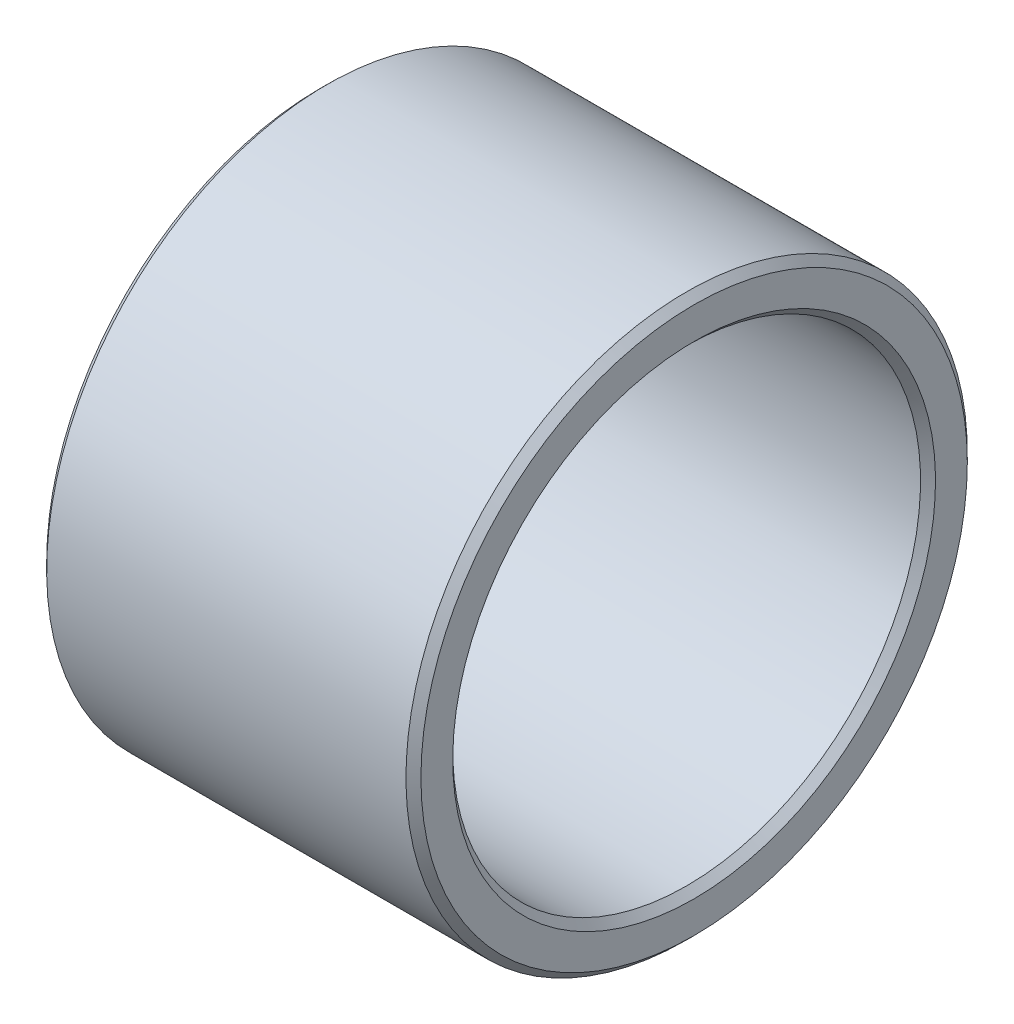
ISO-10303-21;
HEADER;
FILE_DESCRIPTION(('STEP AP214'),'2;1');
FILE_NAME('part.step','',(''),(''),'','','');
FILE_SCHEMA(('AUTOMOTIVE_DESIGN { 1 0 10303 214 1 1 1 1 }'));
ENDSEC;
DATA;
#1=APPLICATION_CONTEXT('core data for automotive mechanical design processes');
#2=APPLICATION_PROTOCOL_DEFINITION('international standard','automotive_design',2000,#1);
#3=PRODUCT_CONTEXT('',#1,'mechanical');
#4=PRODUCT('Part','Part','',(#3));
#5=PRODUCT_RELATED_PRODUCT_CATEGORY('part','',(#4));
#6=PRODUCT_DEFINITION_FORMATION('','',#4);
#7=PRODUCT_DEFINITION_CONTEXT('part definition',#1,'design');
#8=PRODUCT_DEFINITION('design','',#6,#7);
#9=PRODUCT_DEFINITION_SHAPE('','',#8);
#10=(LENGTH_UNIT() NAMED_UNIT(*) SI_UNIT(.MILLI.,.METRE.));
#11=(NAMED_UNIT(*) PLANE_ANGLE_UNIT() SI_UNIT($,.RADIAN.));
#12=(NAMED_UNIT(*) SI_UNIT($,.STERADIAN.) SOLID_ANGLE_UNIT());
#13=UNCERTAINTY_MEASURE_WITH_UNIT(LENGTH_MEASURE(1.E-05),#10,'distance_accuracy_value','');
#14=(GEOMETRIC_REPRESENTATION_CONTEXT(3) GLOBAL_UNCERTAINTY_ASSIGNED_CONTEXT((#13)) GLOBAL_UNIT_ASSIGNED_CONTEXT((#10,
#11,#12)) REPRESENTATION_CONTEXT('',''));
#15=CARTESIAN_POINT('',(0.,0.,0.));
#16=DIRECTION('',(0.,0.,1.));
#17=DIRECTION('',(1.,0.,0.));
#18=AXIS2_PLACEMENT_3D('',#15,#16,#17);
#19=CARTESIAN_POINT('',(0.,-13.75,0.));
#20=DIRECTION('',(-1.,0.,0.));
#21=DIRECTION('',(0.,1.,0.));
#22=AXIS2_PLACEMENT_3D('',#19,#20,#21);
#23=PLANE('',#22);
#24=CARTESIAN_POINT('',(0.,0.,0.));
#25=DIRECTION('',(1.,0.,0.));
#26=DIRECTION('',(0.,-1.,0.));
#27=AXIS2_PLACEMENT_3D('',#24,#25,#26);
#28=CIRCLE('',#27,12.9);
#29=CARTESIAN_POINT('',(0.,-12.9,0.));
#30=VERTEX_POINT('',#29);
#31=EDGE_CURVE('E9',#30,#30,#28,.T.);
#32=ORIENTED_EDGE('',*,*,#31,.T.);
#33=EDGE_LOOP('',(#32));
#34=FACE_BOUND('',#33,.T.);
#35=CARTESIAN_POINT('',(0.,0.,0.));
#36=DIRECTION('',(1.,0.,0.));
#37=DIRECTION('',(0.,-1.,0.));
#38=AXIS2_PLACEMENT_3D('',#35,#36,#37);
#39=CIRCLE('',#38,14.6);
#40=CARTESIAN_POINT('',(0.,-14.6,0.));
#41=VERTEX_POINT('',#40);
#42=EDGE_CURVE('E53',#41,#41,#39,.T.);
#43=ORIENTED_EDGE('',*,*,#42,.F.);
#44=EDGE_LOOP('',(#43));
#45=FACE_BOUND('',#44,.T.);
#46=ADVANCED_FACE('F15',(#34,#45),#23,.T.);
#47=CARTESIAN_POINT('',(0.2,0.,0.));
#48=DIRECTION('',(-1.,0.,0.));
#49=DIRECTION('',(0.,-1.,0.));
#50=AXIS2_PLACEMENT_3D('',#47,#48,#49);
#51=CONICAL_SURFACE('',#50,12.7,0.785398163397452);
#52=CARTESIAN_POINT('',(0.4,0.,0.));
#53=DIRECTION('',(1.,0.,0.));
#54=DIRECTION('',(0.,-1.,0.));
#55=AXIS2_PLACEMENT_3D('',#52,#53,#54);
#56=CIRCLE('',#55,12.5);
#57=CARTESIAN_POINT('',(0.4,-12.5,0.));
#58=VERTEX_POINT('',#57);
#59=EDGE_CURVE('E22',#58,#58,#56,.T.);
#60=ORIENTED_EDGE('',*,*,#59,.T.);
#61=EDGE_LOOP('',(#60));
#62=FACE_BOUND('',#61,.T.);
#63=ORIENTED_EDGE('',*,*,#31,.F.);
#64=EDGE_LOOP('',(#63));
#65=FACE_BOUND('',#64,.T.);
#66=ADVANCED_FACE('F82',(#62,#65),#51,.F.);
#67=CARTESIAN_POINT('',(10.,0.,0.));
#68=DIRECTION('',(-1.,0.,0.));
#69=DIRECTION('',(0.,-1.,0.));
#70=AXIS2_PLACEMENT_3D('',#67,#68,#69);
#71=CYLINDRICAL_SURFACE('',#70,12.5);
#72=CARTESIAN_POINT('',(19.6,0.,0.));
#73=DIRECTION('',(1.,0.,0.));
#74=DIRECTION('',(0.,-1.,0.));
#75=AXIS2_PLACEMENT_3D('',#72,#73,#74);
#76=CIRCLE('',#75,12.5);
#77=CARTESIAN_POINT('',(19.6,-12.5,0.));
#78=VERTEX_POINT('',#77);
#79=EDGE_CURVE('E58',#78,#78,#76,.T.);
#80=ORIENTED_EDGE('',*,*,#79,.T.);
#81=EDGE_LOOP('',(#80));
#82=FACE_BOUND('',#81,.T.);
#83=ORIENTED_EDGE('',*,*,#59,.F.);
#84=EDGE_LOOP('',(#83));
#85=FACE_BOUND('',#84,.T.);
#86=ADVANCED_FACE('F66',(#82,#85),#71,.F.);
#87=CARTESIAN_POINT('',(19.8,0.,0.));
#88=DIRECTION('',(1.,0.,0.));
#89=DIRECTION('',(0.,-1.,0.));
#90=AXIS2_PLACEMENT_3D('',#87,#88,#89);
#91=CONICAL_SURFACE('',#90,12.7,0.785398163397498);
#92=CARTESIAN_POINT('',(20.,0.,0.));
#93=DIRECTION('',(1.,0.,0.));
#94=DIRECTION('',(0.,-1.,0.));
#95=AXIS2_PLACEMENT_3D('',#92,#93,#94);
#96=CIRCLE('',#95,12.9);
#97=CARTESIAN_POINT('',(20.,-12.9,0.));
#98=VERTEX_POINT('',#97);
#99=EDGE_CURVE('E63',#98,#98,#96,.T.);
#100=ORIENTED_EDGE('',*,*,#99,.T.);
#101=EDGE_LOOP('',(#100));
#102=FACE_BOUND('',#101,.T.);
#103=ORIENTED_EDGE('',*,*,#79,.F.);
#104=EDGE_LOOP('',(#103));
#105=FACE_BOUND('',#104,.T.);
#106=ADVANCED_FACE('F69',(#102,#105),#91,.F.);
#107=CARTESIAN_POINT('',(20.,-13.75,0.));
#108=DIRECTION('',(1.,0.,0.));
#109=DIRECTION('',(0.,-1.,0.));
#110=AXIS2_PLACEMENT_3D('',#107,#108,#109);
#111=PLANE('',#110);
#112=CARTESIAN_POINT('',(20.,0.,0.));
#113=DIRECTION('',(1.,0.,0.));
#114=DIRECTION('',(0.,-1.,0.));
#115=AXIS2_PLACEMENT_3D('',#112,#113,#114);
#116=CIRCLE('',#115,14.6);
#117=CARTESIAN_POINT('',(20.,-14.6,0.));
#118=VERTEX_POINT('',#117);
#119=EDGE_CURVE('E61',#118,#118,#116,.T.);
#120=ORIENTED_EDGE('',*,*,#119,.T.);
#121=EDGE_LOOP('',(#120));
#122=FACE_BOUND('',#121,.T.);
#123=ORIENTED_EDGE('',*,*,#99,.F.);
#124=EDGE_LOOP('',(#123));
#125=FACE_BOUND('',#124,.T.);
#126=ADVANCED_FACE('F71',(#122,#125),#111,.T.);
#127=CARTESIAN_POINT('',(19.8,0.,0.));
#128=DIRECTION('',(-1.,0.,0.));
#129=DIRECTION('',(0.,-1.,0.));
#130=AXIS2_PLACEMENT_3D('',#127,#128,#129);
#131=CONICAL_SURFACE('',#130,14.8,0.785398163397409);
#132=CARTESIAN_POINT('',(19.6,0.,0.));
#133=DIRECTION('',(1.,0.,0.));
#134=DIRECTION('',(0.,-1.,0.));
#135=AXIS2_PLACEMENT_3D('',#132,#133,#134);
#136=CIRCLE('',#135,15.);
#137=CARTESIAN_POINT('',(19.6,-15.,0.));
#138=VERTEX_POINT('',#137);
#139=EDGE_CURVE('E55',#138,#138,#136,.T.);
#140=ORIENTED_EDGE('',*,*,#139,.T.);
#141=EDGE_LOOP('',(#140));
#142=FACE_BOUND('',#141,.T.);
#143=ORIENTED_EDGE('',*,*,#119,.F.);
#144=EDGE_LOOP('',(#143));
#145=FACE_BOUND('',#144,.T.);
#146=ADVANCED_FACE('F79',(#142,#145),#131,.T.);
#147=CARTESIAN_POINT('',(10.,0.,0.));
#148=DIRECTION('',(-1.,0.,0.));
#149=DIRECTION('',(0.,-1.,0.));
#150=AXIS2_PLACEMENT_3D('',#147,#148,#149);
#151=CYLINDRICAL_SURFACE('',#150,15.);
#152=CARTESIAN_POINT('',(0.4,0.,0.));
#153=DIRECTION('',(1.,0.,0.));
#154=DIRECTION('',(0.,-1.,0.));
#155=AXIS2_PLACEMENT_3D('',#152,#153,#154);
#156=CIRCLE('',#155,15.);
#157=CARTESIAN_POINT('',(0.4,-15.,0.));
#158=VERTEX_POINT('',#157);
#159=EDGE_CURVE('E49',#158,#158,#156,.T.);
#160=ORIENTED_EDGE('',*,*,#159,.T.);
#161=EDGE_LOOP('',(#160));
#162=FACE_BOUND('',#161,.T.);
#163=ORIENTED_EDGE('',*,*,#139,.F.);
#164=EDGE_LOOP('',(#163));
#165=FACE_BOUND('',#164,.T.);
#166=ADVANCED_FACE('F50',(#162,#165),#151,.T.);
#167=CARTESIAN_POINT('',(0.2,0.,0.));
#168=DIRECTION('',(1.,0.,0.));
#169=DIRECTION('',(0.,-1.,0.));
#170=AXIS2_PLACEMENT_3D('',#167,#168,#169);
#171=CONICAL_SURFACE('',#170,14.8,0.785398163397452);
#172=ORIENTED_EDGE('',*,*,#42,.T.);
#173=EDGE_LOOP('',(#172));
#174=FACE_BOUND('',#173,.T.);
#175=ORIENTED_EDGE('',*,*,#159,.F.);
#176=EDGE_LOOP('',(#175));
#177=FACE_BOUND('',#176,.T.);
#178=ADVANCED_FACE('F92',(#174,#177),#171,.T.);
#179=CLOSED_SHELL('',(#46,#66,#86,#106,#126,#146,#166,#178));
#180=MANIFOLD_SOLID_BREP('B1',#179);
#181=ADVANCED_BREP_SHAPE_REPRESENTATION('',(#18,#180),#14);
#182=SHAPE_DEFINITION_REPRESENTATION(#9,#181);
ENDSEC;
END-ISO-10303-21;
